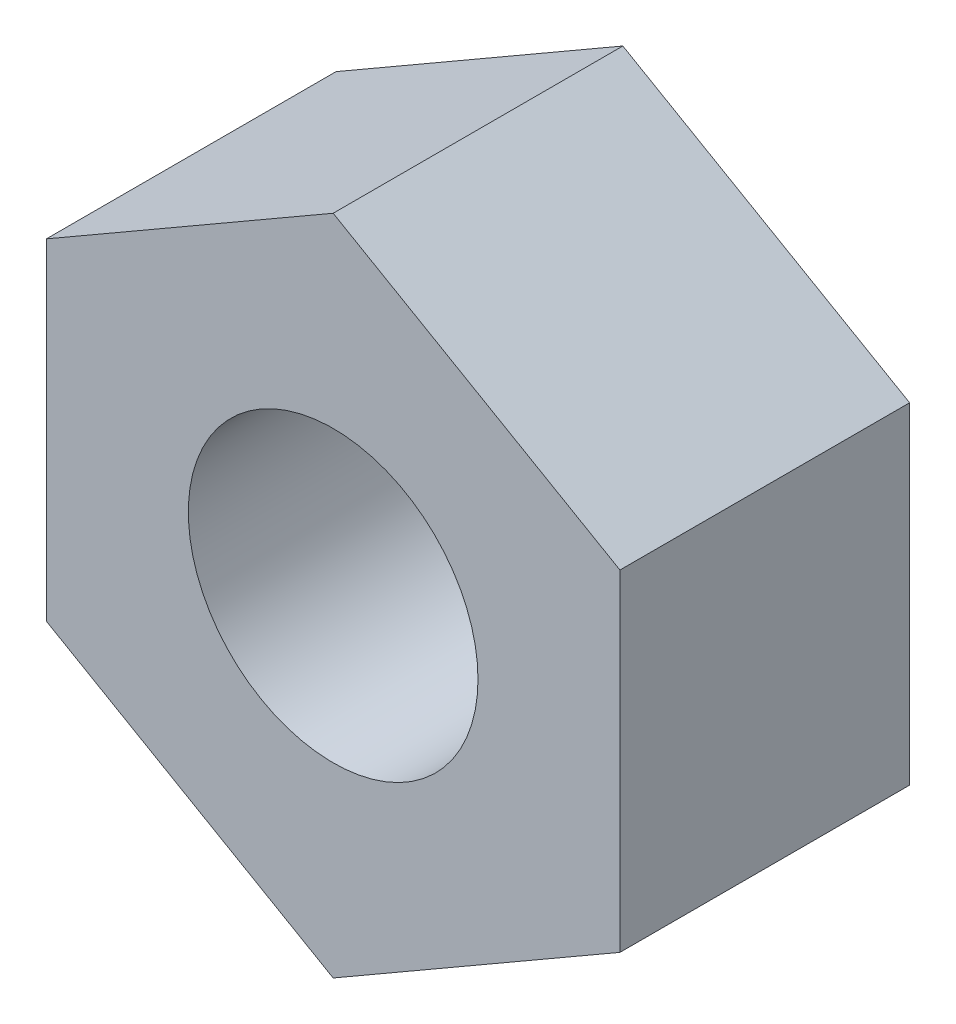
from build123d import *

# Parameters (mm, degrees)
ESQUISSE1_R      = 2.5
EXTRUSION1_DEPTH = 5


with BuildPart() as part:
    # Esquisse1 → Extrusion1 (new body)
    with BuildSketch(Plane.XY):
        Polygon((0, 5.715767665), (-4.95, 2.857883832), (-4.95, -2.857883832), (0, -5.715767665), (4.95, -2.857883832), (4.95, 2.857883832), align=None)
        Circle(ESQUISSE1_R, mode=Mode.SUBTRACT)
    extrude(amount=EXTRUSION1_DEPTH)


solid = part.part
